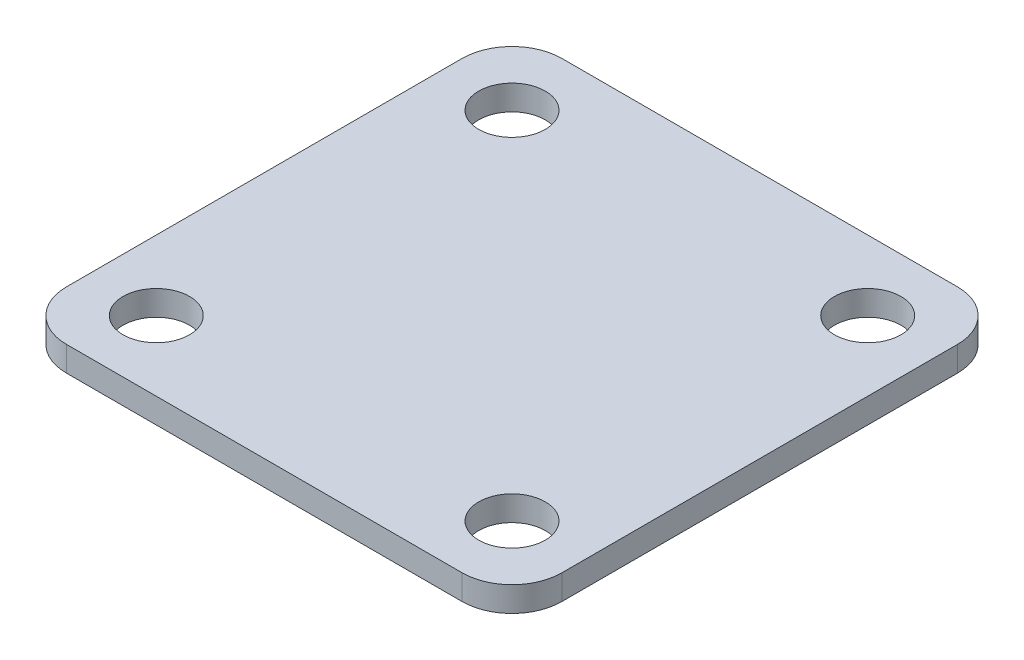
ISO-10303-21;
HEADER;
FILE_DESCRIPTION(('STEP AP214'),'2;1');
FILE_NAME('part.step','',(''),(''),'','','');
FILE_SCHEMA(('AUTOMOTIVE_DESIGN { 1 0 10303 214 1 1 1 1 }'));
ENDSEC;
DATA;
#1=APPLICATION_CONTEXT('core data for automotive mechanical design processes');
#2=APPLICATION_PROTOCOL_DEFINITION('international standard','automotive_design',2000,#1);
#3=PRODUCT_CONTEXT('',#1,'mechanical');
#4=PRODUCT('Part','Part','',(#3));
#5=PRODUCT_RELATED_PRODUCT_CATEGORY('part','',(#4));
#6=PRODUCT_DEFINITION_FORMATION('','',#4);
#7=PRODUCT_DEFINITION_CONTEXT('part definition',#1,'design');
#8=PRODUCT_DEFINITION('design','',#6,#7);
#9=PRODUCT_DEFINITION_SHAPE('','',#8);
#10=(LENGTH_UNIT() NAMED_UNIT(*) SI_UNIT(.MILLI.,.METRE.));
#11=(NAMED_UNIT(*) PLANE_ANGLE_UNIT() SI_UNIT($,.RADIAN.));
#12=(NAMED_UNIT(*) SI_UNIT($,.STERADIAN.) SOLID_ANGLE_UNIT());
#13=UNCERTAINTY_MEASURE_WITH_UNIT(LENGTH_MEASURE(1.E-05),#10,'distance_accuracy_value','');
#14=(GEOMETRIC_REPRESENTATION_CONTEXT(3) GLOBAL_UNCERTAINTY_ASSIGNED_CONTEXT((#13)) GLOBAL_UNIT_ASSIGNED_CONTEXT((#10,
#11,#12)) REPRESENTATION_CONTEXT('',''));
#15=CARTESIAN_POINT('',(0.,0.,0.));
#16=DIRECTION('',(0.,0.,1.));
#17=DIRECTION('',(1.,0.,0.));
#18=AXIS2_PLACEMENT_3D('',#15,#16,#17);
#19=CARTESIAN_POINT('',(0.,1.778,0.));
#20=DIRECTION('',(0.,-1.,0.));
#21=DIRECTION('',(0.,0.,-1.));
#22=AXIS2_PLACEMENT_3D('',#19,#20,#21);
#23=CYLINDRICAL_SURFACE('',#22,3.4925);
#24=CARTESIAN_POINT('',(0.,1.778,0.));
#25=DIRECTION('',(0.,1.,0.));
#26=DIRECTION('',(0.,0.,1.));
#27=AXIS2_PLACEMENT_3D('',#24,#25,#26);
#28=CIRCLE('',#27,3.4925);
#29=CARTESIAN_POINT('',(0.,1.778,3.4925));
#30=VERTEX_POINT('',#29);
#31=EDGE_CURVE('E162',#30,#30,#28,.T.);
#32=ORIENTED_EDGE('',*,*,#31,.F.);
#33=EDGE_LOOP('',(#32));
#34=FACE_BOUND('',#33,.T.);
#35=CARTESIAN_POINT('',(0.,0.,0.));
#36=DIRECTION('',(0.,1.,0.));
#37=DIRECTION('',(0.,0.,1.));
#38=AXIS2_PLACEMENT_3D('',#35,#36,#37);
#39=CIRCLE('',#38,3.4925);
#40=CARTESIAN_POINT('',(0.,0.,3.4925));
#41=VERTEX_POINT('',#40);
#42=EDGE_CURVE('E161',#41,#41,#39,.T.);
#43=ORIENTED_EDGE('',*,*,#42,.T.);
#44=EDGE_LOOP('',(#43));
#45=FACE_BOUND('',#44,.T.);
#46=ADVANCED_FACE('F32',(#34,#45),#23,.T.);
#47=CARTESIAN_POINT('',(0.,0.,0.));
#48=DIRECTION('',(0.,1.,0.));
#49=DIRECTION('',(0.,0.,1.));
#50=AXIS2_PLACEMENT_3D('',#47,#48,#49);
#51=PLANE('',#50);
#52=ORIENTED_EDGE('',*,*,#42,.F.);
#53=EDGE_LOOP('',(#52));
#54=FACE_BOUND('',#53,.T.);
#55=ADVANCED_FACE('F188',(#54),#51,.F.);
#56=CARTESIAN_POINT('',(0.,6.477,0.));
#57=DIRECTION('',(0.,-1.,0.));
#58=DIRECTION('',(0.,0.,-1.));
#59=AXIS2_PLACEMENT_3D('',#56,#57,#58);
#60=CYLINDRICAL_SURFACE('',#59,5.969);
#61=CARTESIAN_POINT('',(0.,3.048,0.));
#62=DIRECTION('',(0.,1.,0.));
#63=DIRECTION('',(0.,0.,1.));
#64=AXIS2_PLACEMENT_3D('',#61,#62,#63);
#65=CIRCLE('',#64,5.969);
#66=CARTESIAN_POINT('',(0.,3.048,5.969));
#67=VERTEX_POINT('',#66);
#68=EDGE_CURVE('E41',#67,#67,#65,.T.);
#69=ORIENTED_EDGE('',*,*,#68,.T.);
#70=EDGE_LOOP('',(#69));
#71=FACE_BOUND('',#70,.T.);
#72=CARTESIAN_POINT('',(0.,5.05460000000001,0.));
#73=DIRECTION('',(0.,1.,0.));
#74=DIRECTION('',(0.,0.,1.));
#75=AXIS2_PLACEMENT_3D('',#72,#73,#74);
#76=CIRCLE('',#75,5.969);
#77=CARTESIAN_POINT('',(0.,5.05460000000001,5.969));
#78=VERTEX_POINT('',#77);
#79=EDGE_CURVE('E170',#78,#78,#76,.F.);
#80=ORIENTED_EDGE('',*,*,#79,.T.);
#81=EDGE_LOOP('',(#80));
#82=FACE_BOUND('',#81,.T.);
#83=ADVANCED_FACE('F175',(#71,#82),#60,.T.);
#84=CARTESIAN_POINT('',(0.,1.778,0.));
#85=DIRECTION('',(0.,1.,0.));
#86=DIRECTION('',(0.,0.,1.));
#87=AXIS2_PLACEMENT_3D('',#84,#85,#86);
#88=PLANE('',#87);
#89=CARTESIAN_POINT('',(0.,1.778,0.));
#90=DIRECTION('',(0.,1.,0.));
#91=DIRECTION('',(0.,0.,1.));
#92=AXIS2_PLACEMENT_3D('',#89,#90,#91);
#93=CIRCLE('',#92,4.699);
#94=CARTESIAN_POINT('',(0.,1.778,4.699));
#95=VERTEX_POINT('',#94);
#96=EDGE_CURVE('E11',#95,#95,#93,.F.);
#97=ORIENTED_EDGE('',*,*,#96,.T.);
#98=EDGE_LOOP('',(#97));
#99=FACE_BOUND('',#98,.T.);
#100=ORIENTED_EDGE('',*,*,#31,.T.);
#101=EDGE_LOOP('',(#100));
#102=FACE_BOUND('',#101,.T.);
#103=ADVANCED_FACE('F201',(#99,#102),#88,.F.);
#104=CARTESIAN_POINT('',(-15.113,8.382,15.113));
#105=DIRECTION('',(0.,1.,0.));
#106=DIRECTION('',(0.,0.,1.));
#107=AXIS2_PLACEMENT_3D('',#104,#105,#106);
#108=PLANE('',#107);
#109=CARTESIAN_POINT('',(13.5890000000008,8.382,13.5889999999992));
#110=DIRECTION('',(0.,1.,0.));
#111=DIRECTION('',(0.,0.,1.));
#112=AXIS2_PLACEMENT_3D('',#109,#110,#111);
#113=CIRCLE('',#112,2.54000000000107);
#114=CARTESIAN_POINT('',(13.5890000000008,8.382,11.0489999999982));
#115=VERTEX_POINT('',#114);
#116=EDGE_CURVE('E266',#115,#115,#113,.T.);
#117=ORIENTED_EDGE('',*,*,#116,.F.);
#118=EDGE_LOOP('',(#117));
#119=FACE_BOUND('',#118,.T.);
#120=CARTESIAN_POINT('',(-13.589,8.382,-13.589));
#121=DIRECTION('',(0.,1.,0.));
#122=DIRECTION('',(0.,0.,1.));
#123=AXIS2_PLACEMENT_3D('',#120,#121,#122);
#124=CIRCLE('',#123,2.54);
#125=CARTESIAN_POINT('',(-13.589,8.382,-16.129));
#126=VERTEX_POINT('',#125);
#127=EDGE_CURVE('E135',#126,#126,#124,.T.);
#128=ORIENTED_EDGE('',*,*,#127,.F.);
#129=EDGE_LOOP('',(#128));
#130=FACE_BOUND('',#129,.T.);
#131=CARTESIAN_POINT('',(-15.113,8.382,15.113));
#132=DIRECTION('',(0.,1.,0.));
#133=DIRECTION('',(0.,0.,1.));
#134=AXIS2_PLACEMENT_3D('',#131,#132,#133);
#135=CIRCLE('',#134,3.81);
#136=CARTESIAN_POINT('',(-18.923,8.382,15.113));
#137=VERTEX_POINT('',#136);
#138=CARTESIAN_POINT('',(-15.113,8.382,18.923));
#139=VERTEX_POINT('',#138);
#140=EDGE_CURVE('E146',#137,#139,#135,.T.);
#141=ORIENTED_EDGE('',*,*,#140,.T.);
#142=DIRECTION('',(1.,0.,0.));
#143=VECTOR('',#142,1.);
#144=CARTESIAN_POINT('',(-15.113,8.382,18.923));
#145=LINE('',#144,#143);
#146=CARTESIAN_POINT('',(15.113,8.382,18.923));
#147=VERTEX_POINT('',#146);
#148=EDGE_CURVE('E93',#139,#147,#145,.T.);
#149=ORIENTED_EDGE('',*,*,#148,.T.);
#150=CARTESIAN_POINT('',(15.113,8.382,15.113));
#151=DIRECTION('',(0.,1.,0.));
#152=DIRECTION('',(0.,0.,1.));
#153=AXIS2_PLACEMENT_3D('',#150,#151,#152);
#154=CIRCLE('',#153,3.81);
#155=CARTESIAN_POINT('',(18.923,8.382,15.113));
#156=VERTEX_POINT('',#155);
#157=EDGE_CURVE('E284',#147,#156,#154,.T.);
#158=ORIENTED_EDGE('',*,*,#157,.T.);
#159=DIRECTION('',(0.,0.,-1.));
#160=VECTOR('',#159,1.);
#161=CARTESIAN_POINT('',(18.923,8.382,-15.113));
#162=LINE('',#161,#160);
#163=CARTESIAN_POINT('',(18.923,8.382,-15.113));
#164=VERTEX_POINT('',#163);
#165=EDGE_CURVE('E286',#156,#164,#162,.T.);
#166=ORIENTED_EDGE('',*,*,#165,.T.);
#167=CARTESIAN_POINT('',(15.113,8.382,-15.113));
#168=DIRECTION('',(0.,1.,0.));
#169=DIRECTION('',(0.,0.,-1.));
#170=AXIS2_PLACEMENT_3D('',#167,#168,#169);
#171=CIRCLE('',#170,3.81);
#172=CARTESIAN_POINT('',(15.113,8.382,-18.923));
#173=VERTEX_POINT('',#172);
#174=EDGE_CURVE('E113',#164,#173,#171,.T.);
#175=ORIENTED_EDGE('',*,*,#174,.T.);
#176=DIRECTION('',(-1.,0.,0.));
#177=VECTOR('',#176,1.);
#178=CARTESIAN_POINT('',(-15.113,8.382,-18.923));
#179=LINE('',#178,#177);
#180=CARTESIAN_POINT('',(-15.113,8.382,-18.923));
#181=VERTEX_POINT('',#180);
#182=EDGE_CURVE('E106',#173,#181,#179,.T.);
#183=ORIENTED_EDGE('',*,*,#182,.T.);
#184=CARTESIAN_POINT('',(-15.113,8.382,-15.113));
#185=DIRECTION('',(0.,1.,0.));
#186=DIRECTION('',(0.,0.,1.));
#187=AXIS2_PLACEMENT_3D('',#184,#185,#186);
#188=CIRCLE('',#187,3.81);
#189=CARTESIAN_POINT('',(-18.923,8.382,-15.113));
#190=VERTEX_POINT('',#189);
#191=EDGE_CURVE('E111',#181,#190,#188,.T.);
#192=ORIENTED_EDGE('',*,*,#191,.T.);
#193=DIRECTION('',(0.,0.,1.));
#194=VECTOR('',#193,1.);
#195=CARTESIAN_POINT('',(-18.923,8.382,-15.113));
#196=LINE('',#195,#194);
#197=EDGE_CURVE('E49',#190,#137,#196,.T.);
#198=ORIENTED_EDGE('',*,*,#197,.T.);
#199=EDGE_LOOP('',(#141,#149,#158,#166,#175,#183,#192,#198));
#200=FACE_BOUND('',#199,.T.);
#201=CARTESIAN_POINT('',(13.589,8.382,-13.5890000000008));
#202=DIRECTION('',(0.,1.,0.));
#203=DIRECTION('',(0.,0.,1.));
#204=AXIS2_PLACEMENT_3D('',#201,#202,#203);
#205=CIRCLE('',#204,2.54000000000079);
#206=CARTESIAN_POINT('',(13.589,8.382,-16.1290000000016));
#207=VERTEX_POINT('',#206);
#208=EDGE_CURVE('E272',#207,#207,#205,.T.);
#209=ORIENTED_EDGE('',*,*,#208,.F.);
#210=EDGE_LOOP('',(#209));
#211=FACE_BOUND('',#210,.T.);
#212=CARTESIAN_POINT('',(-13.5889999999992,8.382,13.589));
#213=DIRECTION('',(0.,1.,0.));
#214=DIRECTION('',(0.,0.,1.));
#215=AXIS2_PLACEMENT_3D('',#212,#213,#214);
#216=CIRCLE('',#215,2.5400000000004);
#217=CARTESIAN_POINT('',(-13.5889999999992,8.382,11.0489999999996));
#218=VERTEX_POINT('',#217);
#219=EDGE_CURVE('E257',#218,#218,#216,.T.);
#220=ORIENTED_EDGE('',*,*,#219,.F.);
#221=EDGE_LOOP('',(#220));
#222=FACE_BOUND('',#221,.T.);
#223=ADVANCED_FACE('F108',(#119,#130,#200,#211,#222),#108,.T.);
#224=CARTESIAN_POINT('',(-15.113,6.477,15.113));
#225=DIRECTION('',(0.,1.,0.));
#226=DIRECTION('',(0.,0.,1.));
#227=AXIS2_PLACEMENT_3D('',#224,#225,#226);
#228=PLANE('',#227);
#229=CARTESIAN_POINT('',(0.,6.477,0.));
#230=DIRECTION('',(0.,1.,0.));
#231=DIRECTION('',(0.,0.,1.));
#232=AXIS2_PLACEMENT_3D('',#229,#230,#231);
#233=CIRCLE('',#232,9.67447868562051);
#234=CARTESIAN_POINT('',(0.,6.477,9.67447868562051));
#235=VERTEX_POINT('',#234);
#236=EDGE_CURVE('E165',#235,#235,#233,.T.);
#237=ORIENTED_EDGE('',*,*,#236,.T.);
#238=EDGE_LOOP('',(#237));
#239=FACE_BOUND('',#238,.T.);
#240=CARTESIAN_POINT('',(-15.113,6.477,15.113));
#241=DIRECTION('',(0.,1.,0.));
#242=DIRECTION('',(0.,0.,1.));
#243=AXIS2_PLACEMENT_3D('',#240,#241,#242);
#244=CIRCLE('',#243,3.81);
#245=CARTESIAN_POINT('',(-18.923,6.477,15.113));
#246=VERTEX_POINT('',#245);
#247=CARTESIAN_POINT('',(-15.113,6.477,18.923));
#248=VERTEX_POINT('',#247);
#249=EDGE_CURVE('E131',#246,#248,#244,.T.);
#250=ORIENTED_EDGE('',*,*,#249,.F.);
#251=DIRECTION('',(0.,0.,1.));
#252=VECTOR('',#251,1.);
#253=CARTESIAN_POINT('',(-18.923,6.477,-15.113));
#254=LINE('',#253,#252);
#255=CARTESIAN_POINT('',(-18.923,6.477,-15.113));
#256=VERTEX_POINT('',#255);
#257=EDGE_CURVE('E84',#256,#246,#254,.T.);
#258=ORIENTED_EDGE('',*,*,#257,.F.);
#259=CARTESIAN_POINT('',(-15.113,6.477,-15.113));
#260=DIRECTION('',(0.,1.,0.));
#261=DIRECTION('',(0.,0.,1.));
#262=AXIS2_PLACEMENT_3D('',#259,#260,#261);
#263=CIRCLE('',#262,3.81);
#264=CARTESIAN_POINT('',(-15.113,6.477,-18.923));
#265=VERTEX_POINT('',#264);
#266=EDGE_CURVE('E78',#265,#256,#263,.T.);
#267=ORIENTED_EDGE('',*,*,#266,.F.);
#268=DIRECTION('',(-1.,0.,0.));
#269=VECTOR('',#268,1.);
#270=CARTESIAN_POINT('',(-15.113,6.477,-18.923));
#271=LINE('',#270,#269);
#272=CARTESIAN_POINT('',(15.113,6.477,-18.923));
#273=VERTEX_POINT('',#272);
#274=EDGE_CURVE('E121',#273,#265,#271,.T.);
#275=ORIENTED_EDGE('',*,*,#274,.F.);
#276=CARTESIAN_POINT('',(15.113,6.477,-15.113));
#277=DIRECTION('',(0.,1.,0.));
#278=DIRECTION('',(0.,0.,-1.));
#279=AXIS2_PLACEMENT_3D('',#276,#277,#278);
#280=CIRCLE('',#279,3.81);
#281=CARTESIAN_POINT('',(18.923,6.477,-15.113));
#282=VERTEX_POINT('',#281);
#283=EDGE_CURVE('E141',#282,#273,#280,.T.);
#284=ORIENTED_EDGE('',*,*,#283,.F.);
#285=DIRECTION('',(0.,0.,-1.));
#286=VECTOR('',#285,1.);
#287=CARTESIAN_POINT('',(18.923,6.477,-15.113));
#288=LINE('',#287,#286);
#289=CARTESIAN_POINT('',(18.923,6.477,15.113));
#290=VERTEX_POINT('',#289);
#291=EDGE_CURVE('E139',#290,#282,#288,.T.);
#292=ORIENTED_EDGE('',*,*,#291,.F.);
#293=CARTESIAN_POINT('',(15.113,6.477,15.113));
#294=DIRECTION('',(0.,1.,0.));
#295=DIRECTION('',(0.,0.,1.));
#296=AXIS2_PLACEMENT_3D('',#293,#294,#295);
#297=CIRCLE('',#296,3.81);
#298=CARTESIAN_POINT('',(15.113,6.477,18.923));
#299=VERTEX_POINT('',#298);
#300=EDGE_CURVE('E137',#299,#290,#297,.T.);
#301=ORIENTED_EDGE('',*,*,#300,.F.);
#302=DIRECTION('',(1.,0.,0.));
#303=VECTOR('',#302,1.);
#304=CARTESIAN_POINT('',(-15.113,6.477,18.923));
#305=LINE('',#304,#303);
#306=EDGE_CURVE('E134',#248,#299,#305,.T.);
#307=ORIENTED_EDGE('',*,*,#306,.F.);
#308=EDGE_LOOP('',(#250,#258,#267,#275,#284,#292,#301,#307));
#309=FACE_BOUND('',#308,.T.);
#310=CARTESIAN_POINT('',(-13.589,6.477,-13.589));
#311=DIRECTION('',(0.,1.,0.));
#312=DIRECTION('',(0.,0.,1.));
#313=AXIS2_PLACEMENT_3D('',#310,#311,#312);
#314=CIRCLE('',#313,2.54);
#315=CARTESIAN_POINT('',(-13.589,6.477,-16.129));
#316=VERTEX_POINT('',#315);
#317=EDGE_CURVE('E275',#316,#316,#314,.T.);
#318=ORIENTED_EDGE('',*,*,#317,.T.);
#319=EDGE_LOOP('',(#318));
#320=FACE_BOUND('',#319,.T.);
#321=CARTESIAN_POINT('',(13.589,6.477,-13.5890000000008));
#322=DIRECTION('',(0.,1.,0.));
#323=DIRECTION('',(0.,0.,1.));
#324=AXIS2_PLACEMENT_3D('',#321,#322,#323);
#325=CIRCLE('',#324,2.54000000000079);
#326=CARTESIAN_POINT('',(13.589,6.477,-16.1290000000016));
#327=VERTEX_POINT('',#326);
#328=EDGE_CURVE('E269',#327,#327,#325,.T.);
#329=ORIENTED_EDGE('',*,*,#328,.T.);
#330=EDGE_LOOP('',(#329));
#331=FACE_BOUND('',#330,.T.);
#332=CARTESIAN_POINT('',(13.5890000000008,6.477,13.5889999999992));
#333=DIRECTION('',(0.,1.,0.));
#334=DIRECTION('',(0.,0.,1.));
#335=AXIS2_PLACEMENT_3D('',#332,#333,#334);
#336=CIRCLE('',#335,2.54000000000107);
#337=CARTESIAN_POINT('',(13.5890000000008,6.477,11.0489999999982));
#338=VERTEX_POINT('',#337);
#339=EDGE_CURVE('E263',#338,#338,#336,.T.);
#340=ORIENTED_EDGE('',*,*,#339,.T.);
#341=EDGE_LOOP('',(#340));
#342=FACE_BOUND('',#341,.T.);
#343=CARTESIAN_POINT('',(-13.5889999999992,6.477,13.589));
#344=DIRECTION('',(0.,1.,0.));
#345=DIRECTION('',(0.,0.,1.));
#346=AXIS2_PLACEMENT_3D('',#343,#344,#345);
#347=CIRCLE('',#346,2.5400000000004);
#348=CARTESIAN_POINT('',(-13.5889999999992,6.477,11.0489999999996));
#349=VERTEX_POINT('',#348);
#350=EDGE_CURVE('E260',#349,#349,#347,.T.);
#351=ORIENTED_EDGE('',*,*,#350,.T.);
#352=EDGE_LOOP('',(#351));
#353=FACE_BOUND('',#352,.T.);
#354=ADVANCED_FACE('F209',(#239,#309,#320,#331,#342,#353),#228,.F.);
#355=CARTESIAN_POINT('',(-15.113,8.382,15.113));
#356=DIRECTION('',(0.,-1.,0.));
#357=DIRECTION('',(0.,0.,-1.));
#358=AXIS2_PLACEMENT_3D('',#355,#356,#357);
#359=CYLINDRICAL_SURFACE('',#358,3.81);
#360=ORIENTED_EDGE('',*,*,#249,.T.);
#361=DIRECTION('',(0.,-1.,0.));
#362=VECTOR('',#361,1.);
#363=CARTESIAN_POINT('',(-15.113,8.382,18.923));
#364=LINE('',#363,#362);
#365=EDGE_CURVE('E159',#139,#248,#364,.T.);
#366=ORIENTED_EDGE('',*,*,#365,.F.);
#367=ORIENTED_EDGE('',*,*,#140,.F.);
#368=DIRECTION('',(0.,-1.,0.));
#369=VECTOR('',#368,1.);
#370=CARTESIAN_POINT('',(-18.923,8.382,15.113));
#371=LINE('',#370,#369);
#372=EDGE_CURVE('E127',#137,#246,#371,.T.);
#373=ORIENTED_EDGE('',*,*,#372,.T.);
#374=EDGE_LOOP('',(#360,#366,#367,#373));
#375=FACE_BOUND('',#374,.T.);
#376=ADVANCED_FACE('F205',(#375),#359,.T.);
#377=CARTESIAN_POINT('',(-15.113,8.382,18.923));
#378=DIRECTION('',(0.,0.,-1.));
#379=DIRECTION('',(-1.,0.,0.));
#380=AXIS2_PLACEMENT_3D('',#377,#378,#379);
#381=PLANE('',#380);
#382=ORIENTED_EDGE('',*,*,#306,.T.);
#383=DIRECTION('',(0.,-1.,0.));
#384=VECTOR('',#383,1.);
#385=CARTESIAN_POINT('',(15.113,8.382,18.923));
#386=LINE('',#385,#384);
#387=EDGE_CURVE('E156',#147,#299,#386,.T.);
#388=ORIENTED_EDGE('',*,*,#387,.F.);
#389=ORIENTED_EDGE('',*,*,#148,.F.);
#390=ORIENTED_EDGE('',*,*,#365,.T.);
#391=EDGE_LOOP('',(#382,#388,#389,#390));
#392=FACE_BOUND('',#391,.T.);
#393=ADVANCED_FACE('F208',(#392),#381,.F.);
#394=CARTESIAN_POINT('',(15.113,8.382,15.113));
#395=DIRECTION('',(0.,-1.,0.));
#396=DIRECTION('',(0.,0.,-1.));
#397=AXIS2_PLACEMENT_3D('',#394,#395,#396);
#398=CYLINDRICAL_SURFACE('',#397,3.81);
#399=ORIENTED_EDGE('',*,*,#300,.T.);
#400=DIRECTION('',(0.,-1.,0.));
#401=VECTOR('',#400,1.);
#402=CARTESIAN_POINT('',(18.923,8.382,15.113));
#403=LINE('',#402,#401);
#404=EDGE_CURVE('E153',#156,#290,#403,.T.);
#405=ORIENTED_EDGE('',*,*,#404,.F.);
#406=ORIENTED_EDGE('',*,*,#157,.F.);
#407=ORIENTED_EDGE('',*,*,#387,.T.);
#408=EDGE_LOOP('',(#399,#405,#406,#407));
#409=FACE_BOUND('',#408,.T.);
#410=ADVANCED_FACE('F213',(#409),#398,.T.);
#411=CARTESIAN_POINT('',(18.923,8.382,-15.113));
#412=DIRECTION('',(-1.,0.,0.));
#413=DIRECTION('',(0.,0.,1.));
#414=AXIS2_PLACEMENT_3D('',#411,#412,#413);
#415=PLANE('',#414);
#416=ORIENTED_EDGE('',*,*,#291,.T.);
#417=DIRECTION('',(0.,-1.,0.));
#418=VECTOR('',#417,1.);
#419=CARTESIAN_POINT('',(18.923,8.382,-15.113));
#420=LINE('',#419,#418);
#421=EDGE_CURVE('E150',#164,#282,#420,.T.);
#422=ORIENTED_EDGE('',*,*,#421,.F.);
#423=ORIENTED_EDGE('',*,*,#165,.F.);
#424=ORIENTED_EDGE('',*,*,#404,.T.);
#425=EDGE_LOOP('',(#416,#422,#423,#424));
#426=FACE_BOUND('',#425,.T.);
#427=ADVANCED_FACE('F216',(#426),#415,.F.);
#428=CARTESIAN_POINT('',(15.113,8.382,-15.113));
#429=DIRECTION('',(0.,-1.,0.));
#430=DIRECTION('',(0.,0.,-1.));
#431=AXIS2_PLACEMENT_3D('',#428,#429,#430);
#432=CYLINDRICAL_SURFACE('',#431,3.81);
#433=ORIENTED_EDGE('',*,*,#283,.T.);
#434=DIRECTION('',(0.,-1.,0.));
#435=VECTOR('',#434,1.);
#436=CARTESIAN_POINT('',(15.113,8.382,-18.923));
#437=LINE('',#436,#435);
#438=EDGE_CURVE('E122',#173,#273,#437,.T.);
#439=ORIENTED_EDGE('',*,*,#438,.F.);
#440=ORIENTED_EDGE('',*,*,#174,.F.);
#441=ORIENTED_EDGE('',*,*,#421,.T.);
#442=EDGE_LOOP('',(#433,#439,#440,#441));
#443=FACE_BOUND('',#442,.T.);
#444=ADVANCED_FACE('F220',(#443),#432,.T.);
#445=CARTESIAN_POINT('',(-15.113,8.382,-18.923));
#446=DIRECTION('',(0.,0.,1.));
#447=DIRECTION('',(1.,0.,0.));
#448=AXIS2_PLACEMENT_3D('',#445,#446,#447);
#449=PLANE('',#448);
#450=ORIENTED_EDGE('',*,*,#274,.T.);
#451=DIRECTION('',(0.,-1.,0.));
#452=VECTOR('',#451,1.);
#453=CARTESIAN_POINT('',(-15.113,8.382,-18.923));
#454=LINE('',#453,#452);
#455=EDGE_CURVE('E118',#181,#265,#454,.T.);
#456=ORIENTED_EDGE('',*,*,#455,.F.);
#457=ORIENTED_EDGE('',*,*,#182,.F.);
#458=ORIENTED_EDGE('',*,*,#438,.T.);
#459=EDGE_LOOP('',(#450,#456,#457,#458));
#460=FACE_BOUND('',#459,.T.);
#461=ADVANCED_FACE('F119',(#460),#449,.F.);
#462=CARTESIAN_POINT('',(-15.113,8.382,-15.113));
#463=DIRECTION('',(0.,-1.,0.));
#464=DIRECTION('',(0.,0.,-1.));
#465=AXIS2_PLACEMENT_3D('',#462,#463,#464);
#466=CYLINDRICAL_SURFACE('',#465,3.81);
#467=ORIENTED_EDGE('',*,*,#266,.T.);
#468=DIRECTION('',(0.,-1.,0.));
#469=VECTOR('',#468,1.);
#470=CARTESIAN_POINT('',(-18.923,8.382,-15.113));
#471=LINE('',#470,#469);
#472=EDGE_CURVE('E123',#190,#256,#471,.T.);
#473=ORIENTED_EDGE('',*,*,#472,.F.);
#474=ORIENTED_EDGE('',*,*,#191,.F.);
#475=ORIENTED_EDGE('',*,*,#455,.T.);
#476=EDGE_LOOP('',(#467,#473,#474,#475));
#477=FACE_BOUND('',#476,.T.);
#478=ADVANCED_FACE('F125',(#477),#466,.T.);
#479=CARTESIAN_POINT('',(-18.923,8.382,-15.113));
#480=DIRECTION('',(1.,0.,0.));
#481=DIRECTION('',(0.,0.,-1.));
#482=AXIS2_PLACEMENT_3D('',#479,#480,#481);
#483=PLANE('',#482);
#484=ORIENTED_EDGE('',*,*,#257,.T.);
#485=ORIENTED_EDGE('',*,*,#372,.F.);
#486=ORIENTED_EDGE('',*,*,#197,.F.);
#487=ORIENTED_EDGE('',*,*,#472,.T.);
#488=EDGE_LOOP('',(#484,#485,#486,#487));
#489=FACE_BOUND('',#488,.T.);
#490=ADVANCED_FACE('F229',(#489),#483,.F.);
#491=CARTESIAN_POINT('',(-13.589,8.382,-13.589));
#492=DIRECTION('',(0.,-1.,0.));
#493=DIRECTION('',(0.,0.,-1.));
#494=AXIS2_PLACEMENT_3D('',#491,#492,#493);
#495=CYLINDRICAL_SURFACE('',#494,2.54);
#496=CARTESIAN_POINT('',(-13.589,8.382,-16.129));
#497=CARTESIAN_POINT('',(-13.589,8.36215625,-16.129));
#498=CARTESIAN_POINT('',(-13.589,8.3423125,-16.129));
#499=CARTESIAN_POINT('',(-13.589,8.302625,-16.129));
#500=CARTESIAN_POINT('',(-13.589,8.28278125,-16.129));
#501=CARTESIAN_POINT('',(-13.589,8.24309375,-16.129));
#502=CARTESIAN_POINT('',(-13.589,8.22325,-16.129));
#503=CARTESIAN_POINT('',(-13.589,8.1835625,-16.129));
#504=CARTESIAN_POINT('',(-13.589,8.16371875,-16.129));
#505=CARTESIAN_POINT('',(-13.589,8.12403125,-16.129));
#506=CARTESIAN_POINT('',(-13.589,8.1041875,-16.129));
#507=CARTESIAN_POINT('',(-13.589,8.0645,-16.129));
#508=CARTESIAN_POINT('',(-13.589,8.04465625,-16.129));
#509=CARTESIAN_POINT('',(-13.589,8.00496875,-16.129));
#510=CARTESIAN_POINT('',(-13.589,7.985125,-16.129));
#511=CARTESIAN_POINT('',(-13.589,7.9454375,-16.129));
#512=CARTESIAN_POINT('',(-13.589,7.92559375,-16.129));
#513=CARTESIAN_POINT('',(-13.589,7.88590625,-16.129));
#514=CARTESIAN_POINT('',(-13.589,7.8660625,-16.129));
#515=CARTESIAN_POINT('',(-13.589,7.826375,-16.129));
#516=CARTESIAN_POINT('',(-13.589,7.80653125,-16.129));
#517=CARTESIAN_POINT('',(-13.589,7.76684375,-16.129));
#518=CARTESIAN_POINT('',(-13.589,7.747,-16.129));
#519=CARTESIAN_POINT('',(-13.589,7.7073125,-16.129));
#520=CARTESIAN_POINT('',(-13.589,7.68746875,-16.129));
#521=CARTESIAN_POINT('',(-13.589,7.64778125,-16.129));
#522=CARTESIAN_POINT('',(-13.589,7.6279375,-16.129));
#523=CARTESIAN_POINT('',(-13.589,7.58825,-16.129));
#524=CARTESIAN_POINT('',(-13.589,7.56840625,-16.129));
#525=CARTESIAN_POINT('',(-13.589,7.52871875,-16.129));
#526=CARTESIAN_POINT('',(-13.589,7.508875,-16.129));
#527=CARTESIAN_POINT('',(-13.589,7.4691875,-16.129));
#528=CARTESIAN_POINT('',(-13.589,7.44934375,-16.129));
#529=CARTESIAN_POINT('',(-13.589,7.40965625,-16.129));
#530=CARTESIAN_POINT('',(-13.589,7.3898125,-16.129));
#531=CARTESIAN_POINT('',(-13.589,7.350125,-16.129));
#532=CARTESIAN_POINT('',(-13.589,7.33028125,-16.129));
#533=CARTESIAN_POINT('',(-13.589,7.29059375,-16.129));
#534=CARTESIAN_POINT('',(-13.589,7.27075,-16.129));
#535=CARTESIAN_POINT('',(-13.589,7.2310625,-16.129));
#536=CARTESIAN_POINT('',(-13.589,7.21121875,-16.129));
#537=CARTESIAN_POINT('',(-13.589,7.17153125,-16.129));
#538=CARTESIAN_POINT('',(-13.589,7.1516875,-16.129));
#539=CARTESIAN_POINT('',(-13.589,7.112,-16.129));
#540=CARTESIAN_POINT('',(-13.589,7.09215625,-16.129));
#541=CARTESIAN_POINT('',(-13.589,7.05246875,-16.129));
#542=CARTESIAN_POINT('',(-13.589,7.032625,-16.129));
#543=CARTESIAN_POINT('',(-13.589,6.9929375,-16.129));
#544=CARTESIAN_POINT('',(-13.589,6.97309375,-16.129));
#545=CARTESIAN_POINT('',(-13.589,6.93340625,-16.129));
#546=CARTESIAN_POINT('',(-13.589,6.9135625,-16.129));
#547=CARTESIAN_POINT('',(-13.589,6.873875,-16.129));
#548=CARTESIAN_POINT('',(-13.589,6.85403125,-16.129));
#549=CARTESIAN_POINT('',(-13.589,6.81434375,-16.129));
#550=CARTESIAN_POINT('',(-13.589,6.7945,-16.129));
#551=CARTESIAN_POINT('',(-13.589,6.7548125,-16.129));
#552=CARTESIAN_POINT('',(-13.589,6.73496875,-16.129));
#553=CARTESIAN_POINT('',(-13.589,6.69528125,-16.129));
#554=CARTESIAN_POINT('',(-13.589,6.6754375,-16.129));
#555=CARTESIAN_POINT('',(-13.589,6.63575,-16.129));
#556=CARTESIAN_POINT('',(-13.589,6.61590625,-16.129));
#557=CARTESIAN_POINT('',(-13.589,6.57621875,-16.129));
#558=CARTESIAN_POINT('',(-13.589,6.556375,-16.129));
#559=CARTESIAN_POINT('',(-13.589,6.5166875,-16.129));
#560=CARTESIAN_POINT('',(-13.589,6.49684375,-16.129));
#561=CARTESIAN_POINT('',(-13.589,6.477,-16.129));
#562=B_SPLINE_CURVE_WITH_KNOTS('',3,(#496,#497,#498,#499,#500,#501,#502,#503,#504,#505,#506,
#507,#508,#509,#510,#511,#512,#513,#514,#515,#516,#517,#518,#519,#520,#521,#522,#523,#524,#525,
#526,#527,#528,#529,#530,#531,#532,#533,#534,#535,#536,#537,#538,#539,#540,#541,#542,#543,#544,
#545,#546,#547,#548,#549,#550,#551,#552,#553,#554,#555,#556,#557,#558,#559,#560,#561),
.UNSPECIFIED.,.F.,.F.,(4,2,2,2,2,2,2,2,2,2,2,2,2,2,2,2,2,2,2,2,2,2,2,2,2,2,2,2,2,2,2,2,4),(0.,
0.0595312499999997,0.119062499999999,0.178593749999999,0.238124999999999,0.297656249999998,
0.3571875,0.41671875,0.476249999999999,0.535781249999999,0.595312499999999,0.654843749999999,
0.714374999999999,0.773906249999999,0.833437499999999,0.892968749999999,0.952499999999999,
1.01203125,1.0715625,1.13109375,1.190625,1.25015625,1.3096875,1.36921875,1.42875,1.48828125,
1.5478125,1.60734375,1.666875,1.72640625,1.7859375,1.84546875,1.905),.UNSPECIFIED.);
#563=EDGE_CURVE('BSEAM232',#126,#316,#562,.T.);
#564=ORIENTED_EDGE('',*,*,#127,.T.);
#565=ORIENTED_EDGE('',*,*,#317,.F.);
#566=ORIENTED_EDGE('',*,*,#563,.T.);
#567=ORIENTED_EDGE('',*,*,#563,.F.);
#568=EDGE_LOOP('',(#564,#566,#565,#567));
#569=FACE_BOUND('',#568,.T.);
#570=ADVANCED_FACE('F232',(#569),#495,.F.);
#571=CARTESIAN_POINT('',(13.589,8.382,-13.5890000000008));
#572=DIRECTION('',(0.,-1.,0.));
#573=DIRECTION('',(0.,0.,-1.));
#574=AXIS2_PLACEMENT_3D('',#571,#572,#573);
#575=CYLINDRICAL_SURFACE('',#574,2.54000000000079);
#576=CARTESIAN_POINT('',(13.589,8.382,-16.1290000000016));
#577=CARTESIAN_POINT('',(13.589,8.36215625,-16.1290000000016));
#578=CARTESIAN_POINT('',(13.589,8.3423125,-16.1290000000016));
#579=CARTESIAN_POINT('',(13.589,8.302625,-16.1290000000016));
#580=CARTESIAN_POINT('',(13.589,8.28278125,-16.1290000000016));
#581=CARTESIAN_POINT('',(13.589,8.24309375,-16.1290000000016));
#582=CARTESIAN_POINT('',(13.589,8.22325,-16.1290000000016));
#583=CARTESIAN_POINT('',(13.589,8.1835625,-16.1290000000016));
#584=CARTESIAN_POINT('',(13.589,8.16371875,-16.1290000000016));
#585=CARTESIAN_POINT('',(13.589,8.12403125,-16.1290000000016));
#586=CARTESIAN_POINT('',(13.589,8.1041875,-16.1290000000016));
#587=CARTESIAN_POINT('',(13.589,8.0645,-16.1290000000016));
#588=CARTESIAN_POINT('',(13.589,8.04465625,-16.1290000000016));
#589=CARTESIAN_POINT('',(13.589,8.00496875,-16.1290000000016));
#590=CARTESIAN_POINT('',(13.589,7.985125,-16.1290000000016));
#591=CARTESIAN_POINT('',(13.589,7.9454375,-16.1290000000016));
#592=CARTESIAN_POINT('',(13.589,7.92559375,-16.1290000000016));
#593=CARTESIAN_POINT('',(13.589,7.88590625,-16.1290000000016));
#594=CARTESIAN_POINT('',(13.589,7.8660625,-16.1290000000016));
#595=CARTESIAN_POINT('',(13.589,7.826375,-16.1290000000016));
#596=CARTESIAN_POINT('',(13.589,7.80653125,-16.1290000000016));
#597=CARTESIAN_POINT('',(13.589,7.76684375,-16.1290000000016));
#598=CARTESIAN_POINT('',(13.589,7.747,-16.1290000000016));
#599=CARTESIAN_POINT('',(13.589,7.7073125,-16.1290000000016));
#600=CARTESIAN_POINT('',(13.589,7.68746875,-16.1290000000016));
#601=CARTESIAN_POINT('',(13.589,7.64778125,-16.1290000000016));
#602=CARTESIAN_POINT('',(13.589,7.6279375,-16.1290000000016));
#603=CARTESIAN_POINT('',(13.589,7.58825,-16.1290000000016));
#604=CARTESIAN_POINT('',(13.589,7.56840625,-16.1290000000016));
#605=CARTESIAN_POINT('',(13.589,7.52871875,-16.1290000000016));
#606=CARTESIAN_POINT('',(13.589,7.508875,-16.1290000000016));
#607=CARTESIAN_POINT('',(13.589,7.4691875,-16.1290000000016));
#608=CARTESIAN_POINT('',(13.589,7.44934375,-16.1290000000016));
#609=CARTESIAN_POINT('',(13.589,7.40965625,-16.1290000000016));
#610=CARTESIAN_POINT('',(13.589,7.3898125,-16.1290000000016));
#611=CARTESIAN_POINT('',(13.589,7.350125,-16.1290000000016));
#612=CARTESIAN_POINT('',(13.589,7.33028125,-16.1290000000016));
#613=CARTESIAN_POINT('',(13.589,7.29059375,-16.1290000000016));
#614=CARTESIAN_POINT('',(13.589,7.27075,-16.1290000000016));
#615=CARTESIAN_POINT('',(13.589,7.2310625,-16.1290000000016));
#616=CARTESIAN_POINT('',(13.589,7.21121875,-16.1290000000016));
#617=CARTESIAN_POINT('',(13.589,7.17153125,-16.1290000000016));
#618=CARTESIAN_POINT('',(13.589,7.1516875,-16.1290000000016));
#619=CARTESIAN_POINT('',(13.589,7.112,-16.1290000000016));
#620=CARTESIAN_POINT('',(13.589,7.09215625,-16.1290000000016));
#621=CARTESIAN_POINT('',(13.589,7.05246875,-16.1290000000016));
#622=CARTESIAN_POINT('',(13.589,7.032625,-16.1290000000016));
#623=CARTESIAN_POINT('',(13.589,6.9929375,-16.1290000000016));
#624=CARTESIAN_POINT('',(13.589,6.97309375,-16.1290000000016));
#625=CARTESIAN_POINT('',(13.589,6.93340625,-16.1290000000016));
#626=CARTESIAN_POINT('',(13.589,6.9135625,-16.1290000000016));
#627=CARTESIAN_POINT('',(13.589,6.873875,-16.1290000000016));
#628=CARTESIAN_POINT('',(13.589,6.85403125,-16.1290000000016));
#629=CARTESIAN_POINT('',(13.589,6.81434375,-16.1290000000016));
#630=CARTESIAN_POINT('',(13.589,6.7945,-16.1290000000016));
#631=CARTESIAN_POINT('',(13.589,6.7548125,-16.1290000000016));
#632=CARTESIAN_POINT('',(13.589,6.73496875,-16.1290000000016));
#633=CARTESIAN_POINT('',(13.589,6.69528125,-16.1290000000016));
#634=CARTESIAN_POINT('',(13.589,6.6754375,-16.1290000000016));
#635=CARTESIAN_POINT('',(13.589,6.63575,-16.1290000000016));
#636=CARTESIAN_POINT('',(13.589,6.61590625,-16.1290000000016));
#637=CARTESIAN_POINT('',(13.589,6.57621875,-16.1290000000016));
#638=CARTESIAN_POINT('',(13.589,6.556375,-16.1290000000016));
#639=CARTESIAN_POINT('',(13.589,6.5166875,-16.1290000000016));
#640=CARTESIAN_POINT('',(13.589,6.49684375,-16.1290000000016));
#641=CARTESIAN_POINT('',(13.589,6.477,-16.1290000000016));
#642=B_SPLINE_CURVE_WITH_KNOTS('',3,(#576,#577,#578,#579,#580,#581,#582,#583,#584,#585,#586,
#587,#588,#589,#590,#591,#592,#593,#594,#595,#596,#597,#598,#599,#600,#601,#602,#603,#604,#605,
#606,#607,#608,#609,#610,#611,#612,#613,#614,#615,#616,#617,#618,#619,#620,#621,#622,#623,#624,
#625,#626,#627,#628,#629,#630,#631,#632,#633,#634,#635,#636,#637,#638,#639,#640,#641),
.UNSPECIFIED.,.F.,.F.,(4,2,2,2,2,2,2,2,2,2,2,2,2,2,2,2,2,2,2,2,2,2,2,2,2,2,2,2,2,2,2,2,4),(0.,
0.0595312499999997,0.119062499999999,0.178593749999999,0.238124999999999,0.297656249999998,
0.3571875,0.41671875,0.476249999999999,0.535781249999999,0.595312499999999,0.654843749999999,
0.714374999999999,0.773906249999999,0.833437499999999,0.892968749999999,0.952499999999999,
1.01203125,1.0715625,1.13109375,1.190625,1.25015625,1.3096875,1.36921875,1.42875,1.48828125,
1.5478125,1.60734375,1.666875,1.72640625,1.7859375,1.84546875,1.905),.UNSPECIFIED.);
#643=EDGE_CURVE('BSEAM241',#207,#327,#642,.T.);
#644=ORIENTED_EDGE('',*,*,#208,.T.);
#645=ORIENTED_EDGE('',*,*,#328,.F.);
#646=ORIENTED_EDGE('',*,*,#643,.T.);
#647=ORIENTED_EDGE('',*,*,#643,.F.);
#648=EDGE_LOOP('',(#644,#646,#645,#647));
#649=FACE_BOUND('',#648,.T.);
#650=ADVANCED_FACE('F241',(#649),#575,.F.);
#651=CARTESIAN_POINT('',(13.5890000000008,8.382,13.5889999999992));
#652=DIRECTION('',(0.,-1.,0.));
#653=DIRECTION('',(0.,0.,-1.));
#654=AXIS2_PLACEMENT_3D('',#651,#652,#653);
#655=CYLINDRICAL_SURFACE('',#654,2.54000000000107);
#656=CARTESIAN_POINT('',(13.5890000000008,8.382,11.0489999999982));
#657=CARTESIAN_POINT('',(13.5890000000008,8.36215625,11.0489999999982));
#658=CARTESIAN_POINT('',(13.5890000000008,8.3423125,11.0489999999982));
#659=CARTESIAN_POINT('',(13.5890000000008,8.302625,11.0489999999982));
#660=CARTESIAN_POINT('',(13.5890000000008,8.28278125,11.0489999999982));
#661=CARTESIAN_POINT('',(13.5890000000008,8.24309375,11.0489999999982));
#662=CARTESIAN_POINT('',(13.5890000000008,8.22325,11.0489999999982));
#663=CARTESIAN_POINT('',(13.5890000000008,8.1835625,11.0489999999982));
#664=CARTESIAN_POINT('',(13.5890000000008,8.16371875,11.0489999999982));
#665=CARTESIAN_POINT('',(13.5890000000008,8.12403125,11.0489999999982));
#666=CARTESIAN_POINT('',(13.5890000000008,8.1041875,11.0489999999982));
#667=CARTESIAN_POINT('',(13.5890000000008,8.0645,11.0489999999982));
#668=CARTESIAN_POINT('',(13.5890000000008,8.04465625,11.0489999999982));
#669=CARTESIAN_POINT('',(13.5890000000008,8.00496875,11.0489999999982));
#670=CARTESIAN_POINT('',(13.5890000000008,7.985125,11.0489999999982));
#671=CARTESIAN_POINT('',(13.5890000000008,7.9454375,11.0489999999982));
#672=CARTESIAN_POINT('',(13.5890000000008,7.92559375,11.0489999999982));
#673=CARTESIAN_POINT('',(13.5890000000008,7.88590625,11.0489999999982));
#674=CARTESIAN_POINT('',(13.5890000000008,7.8660625,11.0489999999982));
#675=CARTESIAN_POINT('',(13.5890000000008,7.826375,11.0489999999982));
#676=CARTESIAN_POINT('',(13.5890000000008,7.80653125,11.0489999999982));
#677=CARTESIAN_POINT('',(13.5890000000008,7.76684375,11.0489999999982));
#678=CARTESIAN_POINT('',(13.5890000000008,7.747,11.0489999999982));
#679=CARTESIAN_POINT('',(13.5890000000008,7.7073125,11.0489999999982));
#680=CARTESIAN_POINT('',(13.5890000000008,7.68746875,11.0489999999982));
#681=CARTESIAN_POINT('',(13.5890000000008,7.64778125,11.0489999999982));
#682=CARTESIAN_POINT('',(13.5890000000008,7.6279375,11.0489999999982));
#683=CARTESIAN_POINT('',(13.5890000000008,7.58825,11.0489999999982));
#684=CARTESIAN_POINT('',(13.5890000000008,7.56840625,11.0489999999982));
#685=CARTESIAN_POINT('',(13.5890000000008,7.52871875,11.0489999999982));
#686=CARTESIAN_POINT('',(13.5890000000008,7.508875,11.0489999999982));
#687=CARTESIAN_POINT('',(13.5890000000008,7.4691875,11.0489999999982));
#688=CARTESIAN_POINT('',(13.5890000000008,7.44934375,11.0489999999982));
#689=CARTESIAN_POINT('',(13.5890000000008,7.40965625,11.0489999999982));
#690=CARTESIAN_POINT('',(13.5890000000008,7.3898125,11.0489999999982));
#691=CARTESIAN_POINT('',(13.5890000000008,7.350125,11.0489999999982));
#692=CARTESIAN_POINT('',(13.5890000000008,7.33028125,11.0489999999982));
#693=CARTESIAN_POINT('',(13.5890000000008,7.29059375,11.0489999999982));
#694=CARTESIAN_POINT('',(13.5890000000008,7.27075,11.0489999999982));
#695=CARTESIAN_POINT('',(13.5890000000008,7.2310625,11.0489999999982));
#696=CARTESIAN_POINT('',(13.5890000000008,7.21121875,11.0489999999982));
#697=CARTESIAN_POINT('',(13.5890000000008,7.17153125,11.0489999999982));
#698=CARTESIAN_POINT('',(13.5890000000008,7.1516875,11.0489999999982));
#699=CARTESIAN_POINT('',(13.5890000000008,7.112,11.0489999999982));
#700=CARTESIAN_POINT('',(13.5890000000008,7.09215625,11.0489999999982));
#701=CARTESIAN_POINT('',(13.5890000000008,7.05246875,11.0489999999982));
#702=CARTESIAN_POINT('',(13.5890000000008,7.032625,11.0489999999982));
#703=CARTESIAN_POINT('',(13.5890000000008,6.9929375,11.0489999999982));
#704=CARTESIAN_POINT('',(13.5890000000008,6.97309375,11.0489999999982));
#705=CARTESIAN_POINT('',(13.5890000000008,6.93340625,11.0489999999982));
#706=CARTESIAN_POINT('',(13.5890000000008,6.9135625,11.0489999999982));
#707=CARTESIAN_POINT('',(13.5890000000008,6.873875,11.0489999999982));
#708=CARTESIAN_POINT('',(13.5890000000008,6.85403125,11.0489999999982));
#709=CARTESIAN_POINT('',(13.5890000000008,6.81434375,11.0489999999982));
#710=CARTESIAN_POINT('',(13.5890000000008,6.7945,11.0489999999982));
#711=CARTESIAN_POINT('',(13.5890000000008,6.7548125,11.0489999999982));
#712=CARTESIAN_POINT('',(13.5890000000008,6.73496875,11.0489999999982));
#713=CARTESIAN_POINT('',(13.5890000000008,6.69528125,11.0489999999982));
#714=CARTESIAN_POINT('',(13.5890000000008,6.6754375,11.0489999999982));
#715=CARTESIAN_POINT('',(13.5890000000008,6.63575,11.0489999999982));
#716=CARTESIAN_POINT('',(13.5890000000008,6.61590625,11.0489999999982));
#717=CARTESIAN_POINT('',(13.5890000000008,6.57621875,11.0489999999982));
#718=CARTESIAN_POINT('',(13.5890000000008,6.556375,11.0489999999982));
#719=CARTESIAN_POINT('',(13.5890000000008,6.5166875,11.0489999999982));
#720=CARTESIAN_POINT('',(13.5890000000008,6.49684375,11.0489999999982));
#721=CARTESIAN_POINT('',(13.5890000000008,6.477,11.0489999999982));
#722=B_SPLINE_CURVE_WITH_KNOTS('',3,(#656,#657,#658,#659,#660,#661,#662,#663,#664,#665,#666,
#667,#668,#669,#670,#671,#672,#673,#674,#675,#676,#677,#678,#679,#680,#681,#682,#683,#684,#685,
#686,#687,#688,#689,#690,#691,#692,#693,#694,#695,#696,#697,#698,#699,#700,#701,#702,#703,#704,
#705,#706,#707,#708,#709,#710,#711,#712,#713,#714,#715,#716,#717,#718,#719,#720,#721),
.UNSPECIFIED.,.F.,.F.,(4,2,2,2,2,2,2,2,2,2,2,2,2,2,2,2,2,2,2,2,2,2,2,2,2,2,2,2,2,2,2,2,4),(0.,
0.0595312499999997,0.119062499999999,0.178593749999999,0.238124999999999,0.297656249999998,
0.3571875,0.41671875,0.476249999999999,0.535781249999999,0.595312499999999,0.654843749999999,
0.714374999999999,0.773906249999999,0.833437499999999,0.892968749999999,0.952499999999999,
1.01203125,1.0715625,1.13109375,1.190625,1.25015625,1.3096875,1.36921875,1.42875,1.48828125,
1.5478125,1.60734375,1.666875,1.72640625,1.7859375,1.84546875,1.905),.UNSPECIFIED.);
#723=EDGE_CURVE('BSEAM245',#115,#338,#722,.T.);
#724=ORIENTED_EDGE('',*,*,#116,.T.);
#725=ORIENTED_EDGE('',*,*,#339,.F.);
#726=ORIENTED_EDGE('',*,*,#723,.T.);
#727=ORIENTED_EDGE('',*,*,#723,.F.);
#728=EDGE_LOOP('',(#724,#726,#725,#727));
#729=FACE_BOUND('',#728,.T.);
#730=ADVANCED_FACE('F245',(#729),#655,.F.);
#731=CARTESIAN_POINT('',(-13.5889999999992,8.382,13.589));
#732=DIRECTION('',(0.,-1.,0.));
#733=DIRECTION('',(0.,0.,-1.));
#734=AXIS2_PLACEMENT_3D('',#731,#732,#733);
#735=CYLINDRICAL_SURFACE('',#734,2.5400000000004);
#736=CARTESIAN_POINT('',(-13.5889999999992,8.382,11.0489999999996));
#737=CARTESIAN_POINT('',(-13.5889999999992,8.36215625,11.0489999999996));
#738=CARTESIAN_POINT('',(-13.5889999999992,8.3423125,11.0489999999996));
#739=CARTESIAN_POINT('',(-13.5889999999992,8.302625,11.0489999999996));
#740=CARTESIAN_POINT('',(-13.5889999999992,8.28278125,11.0489999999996));
#741=CARTESIAN_POINT('',(-13.5889999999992,8.24309375,11.0489999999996));
#742=CARTESIAN_POINT('',(-13.5889999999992,8.22325,11.0489999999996));
#743=CARTESIAN_POINT('',(-13.5889999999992,8.1835625,11.0489999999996));
#744=CARTESIAN_POINT('',(-13.5889999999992,8.16371875,11.0489999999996));
#745=CARTESIAN_POINT('',(-13.5889999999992,8.12403125,11.0489999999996));
#746=CARTESIAN_POINT('',(-13.5889999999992,8.1041875,11.0489999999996));
#747=CARTESIAN_POINT('',(-13.5889999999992,8.0645,11.0489999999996));
#748=CARTESIAN_POINT('',(-13.5889999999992,8.04465625,11.0489999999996));
#749=CARTESIAN_POINT('',(-13.5889999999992,8.00496875,11.0489999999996));
#750=CARTESIAN_POINT('',(-13.5889999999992,7.985125,11.0489999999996));
#751=CARTESIAN_POINT('',(-13.5889999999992,7.9454375,11.0489999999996));
#752=CARTESIAN_POINT('',(-13.5889999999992,7.92559375,11.0489999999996));
#753=CARTESIAN_POINT('',(-13.5889999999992,7.88590625,11.0489999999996));
#754=CARTESIAN_POINT('',(-13.5889999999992,7.8660625,11.0489999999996));
#755=CARTESIAN_POINT('',(-13.5889999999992,7.826375,11.0489999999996));
#756=CARTESIAN_POINT('',(-13.5889999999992,7.80653125,11.0489999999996));
#757=CARTESIAN_POINT('',(-13.5889999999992,7.76684375,11.0489999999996));
#758=CARTESIAN_POINT('',(-13.5889999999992,7.747,11.0489999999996));
#759=CARTESIAN_POINT('',(-13.5889999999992,7.7073125,11.0489999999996));
#760=CARTESIAN_POINT('',(-13.5889999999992,7.68746875,11.0489999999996));
#761=CARTESIAN_POINT('',(-13.5889999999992,7.64778125,11.0489999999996));
#762=CARTESIAN_POINT('',(-13.5889999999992,7.6279375,11.0489999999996));
#763=CARTESIAN_POINT('',(-13.5889999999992,7.58825,11.0489999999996));
#764=CARTESIAN_POINT('',(-13.5889999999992,7.56840625,11.0489999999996));
#765=CARTESIAN_POINT('',(-13.5889999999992,7.52871875,11.0489999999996));
#766=CARTESIAN_POINT('',(-13.5889999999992,7.508875,11.0489999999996));
#767=CARTESIAN_POINT('',(-13.5889999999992,7.4691875,11.0489999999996));
#768=CARTESIAN_POINT('',(-13.5889999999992,7.44934375,11.0489999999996));
#769=CARTESIAN_POINT('',(-13.5889999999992,7.40965625,11.0489999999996));
#770=CARTESIAN_POINT('',(-13.5889999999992,7.3898125,11.0489999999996));
#771=CARTESIAN_POINT('',(-13.5889999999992,7.350125,11.0489999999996));
#772=CARTESIAN_POINT('',(-13.5889999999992,7.33028125,11.0489999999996));
#773=CARTESIAN_POINT('',(-13.5889999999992,7.29059375,11.0489999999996));
#774=CARTESIAN_POINT('',(-13.5889999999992,7.27075,11.0489999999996));
#775=CARTESIAN_POINT('',(-13.5889999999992,7.2310625,11.0489999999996));
#776=CARTESIAN_POINT('',(-13.5889999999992,7.21121875,11.0489999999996));
#777=CARTESIAN_POINT('',(-13.5889999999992,7.17153125,11.0489999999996));
#778=CARTESIAN_POINT('',(-13.5889999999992,7.1516875,11.0489999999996));
#779=CARTESIAN_POINT('',(-13.5889999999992,7.112,11.0489999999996));
#780=CARTESIAN_POINT('',(-13.5889999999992,7.09215625,11.0489999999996));
#781=CARTESIAN_POINT('',(-13.5889999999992,7.05246875,11.0489999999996));
#782=CARTESIAN_POINT('',(-13.5889999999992,7.032625,11.0489999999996));
#783=CARTESIAN_POINT('',(-13.5889999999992,6.9929375,11.0489999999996));
#784=CARTESIAN_POINT('',(-13.5889999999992,6.97309375,11.0489999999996));
#785=CARTESIAN_POINT('',(-13.5889999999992,6.93340625,11.0489999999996));
#786=CARTESIAN_POINT('',(-13.5889999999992,6.9135625,11.0489999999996));
#787=CARTESIAN_POINT('',(-13.5889999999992,6.873875,11.0489999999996));
#788=CARTESIAN_POINT('',(-13.5889999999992,6.85403125,11.0489999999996));
#789=CARTESIAN_POINT('',(-13.5889999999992,6.81434375,11.0489999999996));
#790=CARTESIAN_POINT('',(-13.5889999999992,6.7945,11.0489999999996));
#791=CARTESIAN_POINT('',(-13.5889999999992,6.7548125,11.0489999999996));
#792=CARTESIAN_POINT('',(-13.5889999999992,6.73496875,11.0489999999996));
#793=CARTESIAN_POINT('',(-13.5889999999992,6.69528125,11.0489999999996));
#794=CARTESIAN_POINT('',(-13.5889999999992,6.6754375,11.0489999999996));
#795=CARTESIAN_POINT('',(-13.5889999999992,6.63575,11.0489999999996));
#796=CARTESIAN_POINT('',(-13.5889999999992,6.61590625,11.0489999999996));
#797=CARTESIAN_POINT('',(-13.5889999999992,6.57621875,11.0489999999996));
#798=CARTESIAN_POINT('',(-13.5889999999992,6.556375,11.0489999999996));
#799=CARTESIAN_POINT('',(-13.5889999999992,6.5166875,11.0489999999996));
#800=CARTESIAN_POINT('',(-13.5889999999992,6.49684375,11.0489999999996));
#801=CARTESIAN_POINT('',(-13.5889999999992,6.477,11.0489999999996));
#802=B_SPLINE_CURVE_WITH_KNOTS('',3,(#736,#737,#738,#739,#740,#741,#742,#743,#744,#745,#746,
#747,#748,#749,#750,#751,#752,#753,#754,#755,#756,#757,#758,#759,#760,#761,#762,#763,#764,#765,
#766,#767,#768,#769,#770,#771,#772,#773,#774,#775,#776,#777,#778,#779,#780,#781,#782,#783,#784,
#785,#786,#787,#788,#789,#790,#791,#792,#793,#794,#795,#796,#797,#798,#799,#800,#801),
.UNSPECIFIED.,.F.,.F.,(4,2,2,2,2,2,2,2,2,2,2,2,2,2,2,2,2,2,2,2,2,2,2,2,2,2,2,2,2,2,2,2,4),(0.,
0.0595312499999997,0.119062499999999,0.178593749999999,0.238124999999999,0.297656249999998,
0.3571875,0.41671875,0.476249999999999,0.535781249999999,0.595312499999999,0.654843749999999,
0.714374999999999,0.773906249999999,0.833437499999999,0.892968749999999,0.952499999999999,
1.01203125,1.0715625,1.13109375,1.190625,1.25015625,1.3096875,1.36921875,1.42875,1.48828125,
1.5478125,1.60734375,1.666875,1.72640625,1.7859375,1.84546875,1.905),.UNSPECIFIED.);
#803=EDGE_CURVE('BSEAM184',#218,#349,#802,.T.);
#804=ORIENTED_EDGE('',*,*,#219,.T.);
#805=ORIENTED_EDGE('',*,*,#350,.F.);
#806=ORIENTED_EDGE('',*,*,#803,.T.);
#807=ORIENTED_EDGE('',*,*,#803,.F.);
#808=EDGE_LOOP('',(#804,#806,#805,#807));
#809=FACE_BOUND('',#808,.T.);
#810=ADVANCED_FACE('F184',(#809),#735,.F.);
#811=CARTESIAN_POINT('',(0.,6.477,0.));
#812=DIRECTION('',(0.,1.,0.));
#813=DIRECTION('',(0.,0.,1.));
#814=AXIS2_PLACEMENT_3D('',#811,#812,#813);
#815=CONICAL_SURFACE('',#814,9.67447868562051,1.20427718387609);
#816=ORIENTED_EDGE('',*,*,#79,.F.);
#817=EDGE_LOOP('',(#816));
#818=FACE_BOUND('',#817,.T.);
#819=ORIENTED_EDGE('',*,*,#236,.F.);
#820=EDGE_LOOP('',(#819));
#821=FACE_BOUND('',#820,.T.);
#822=ADVANCED_FACE('F179',(#818,#821),#815,.T.);
#823=CARTESIAN_POINT('',(0.,3.048,0.));
#824=DIRECTION('',(0.,1.,0.));
#825=DIRECTION('',(0.,0.,1.));
#826=AXIS2_PLACEMENT_3D('',#823,#824,#825);
#827=TOROIDAL_SURFACE('',#826,4.699,1.27);
#828=ORIENTED_EDGE('',*,*,#96,.F.);
#829=EDGE_LOOP('',(#828));
#830=FACE_BOUND('',#829,.T.);
#831=ORIENTED_EDGE('',*,*,#68,.F.);
#832=EDGE_LOOP('',(#831));
#833=FACE_BOUND('',#832,.T.);
#834=ADVANCED_FACE('F34',(#830,#833),#827,.T.);
#835=CLOSED_SHELL('',(#46,#55,#83,#103,#223,#354,#376,#393,#410,#427,#444,#461,#478,#490,#570,
#650,#730,#810,#822,#834));
#836=MANIFOLD_SOLID_BREP('B2',#835);
#837=ADVANCED_BREP_SHAPE_REPRESENTATION('',(#18,#836),#14);
#838=SHAPE_DEFINITION_REPRESENTATION(#9,#837);
ENDSEC;
END-ISO-10303-21;
